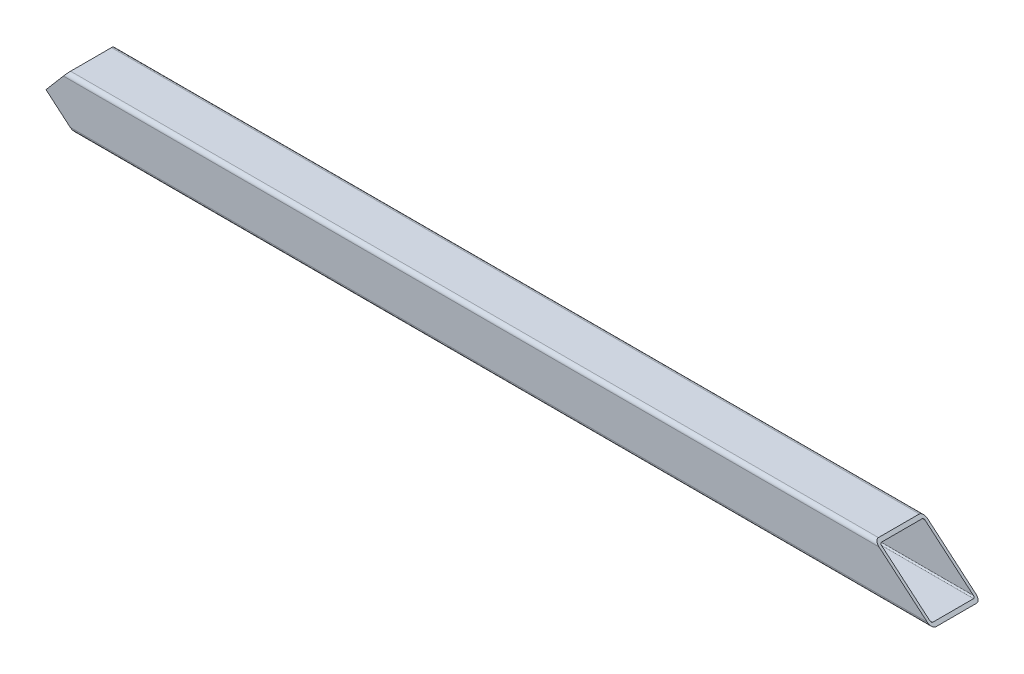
ISO-10303-21;
HEADER;
FILE_DESCRIPTION(('STEP AP214'),'2;1');
FILE_NAME('part.step','',(''),(''),'','','');
FILE_SCHEMA(('AUTOMOTIVE_DESIGN { 1 0 10303 214 1 1 1 1 }'));
ENDSEC;
DATA;
#1=APPLICATION_CONTEXT('core data for automotive mechanical design processes');
#2=APPLICATION_PROTOCOL_DEFINITION('international standard','automotive_design',2000,#1);
#3=PRODUCT_CONTEXT('',#1,'mechanical');
#4=PRODUCT('Part','Part','',(#3));
#5=PRODUCT_RELATED_PRODUCT_CATEGORY('part','',(#4));
#6=PRODUCT_DEFINITION_FORMATION('','',#4);
#7=PRODUCT_DEFINITION_CONTEXT('part definition',#1,'design');
#8=PRODUCT_DEFINITION('design','',#6,#7);
#9=PRODUCT_DEFINITION_SHAPE('','',#8);
#10=(LENGTH_UNIT() NAMED_UNIT(*) SI_UNIT(.MILLI.,.METRE.));
#11=(NAMED_UNIT(*) PLANE_ANGLE_UNIT() SI_UNIT($,.RADIAN.));
#12=(NAMED_UNIT(*) SI_UNIT($,.STERADIAN.) SOLID_ANGLE_UNIT());
#13=UNCERTAINTY_MEASURE_WITH_UNIT(LENGTH_MEASURE(1.E-05),#10,'distance_accuracy_value','');
#14=(GEOMETRIC_REPRESENTATION_CONTEXT(3) GLOBAL_UNCERTAINTY_ASSIGNED_CONTEXT((#13)) GLOBAL_UNIT_ASSIGNED_CONTEXT((#10,
#11,#12)) REPRESENTATION_CONTEXT('',''));
#15=CARTESIAN_POINT('',(0.,0.,0.));
#16=DIRECTION('',(0.,0.,1.));
#17=DIRECTION('',(1.,0.,0.));
#18=AXIS2_PLACEMENT_3D('',#15,#16,#17);
#19=CARTESIAN_POINT('',(698.5,1.651,29.21));
#20=DIRECTION('',(0.,1.,0.));
#21=DIRECTION('',(0.,0.,1.));
#22=AXIS2_PLACEMENT_3D('',#19,#20,#21);
#23=PLANE('',#22);
#24=DIRECTION('',(0.,0.,1.));
#25=VECTOR('',#24,1.);
#26=CARTESIAN_POINT('',(575.714429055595,1.651,29.21));
#27=LINE('',#26,#25);
#28=CARTESIAN_POINT('',(575.714429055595,1.651,2.54000000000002));
#29=VERTEX_POINT('',#28);
#30=CARTESIAN_POINT('',(575.714429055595,1.651,29.21));
#31=VERTEX_POINT('',#30);
#32=EDGE_CURVE('E47',#29,#31,#27,.T.);
#33=ORIENTED_EDGE('',*,*,#32,.F.);
#34=DIRECTION('',(-1.,0.,0.));
#35=VECTOR('',#34,1.);
#36=CARTESIAN_POINT('',(698.5,1.651,2.54000000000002));
#37=LINE('',#36,#35);
#38=CARTESIAN_POINT('',(16.7396240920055,1.651,2.54000000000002));
#39=VERTEX_POINT('',#38);
#40=EDGE_CURVE('E257',#29,#39,#37,.T.);
#41=ORIENTED_EDGE('',*,*,#40,.T.);
#42=DIRECTION('',(0.,0.,-1.));
#43=VECTOR('',#42,1.);
#44=CARTESIAN_POINT('',(16.7396240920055,1.651,29.21));
#45=LINE('',#44,#43);
#46=CARTESIAN_POINT('',(16.7396240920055,1.651,29.21));
#47=VERTEX_POINT('',#46);
#48=EDGE_CURVE('E302',#47,#39,#45,.T.);
#49=ORIENTED_EDGE('',*,*,#48,.F.);
#50=DIRECTION('',(-1.,0.,0.));
#51=VECTOR('',#50,1.);
#52=CARTESIAN_POINT('',(698.5,1.651,29.21));
#53=LINE('',#52,#51);
#54=EDGE_CURVE('E260',#31,#47,#53,.T.);
#55=ORIENTED_EDGE('',*,*,#54,.F.);
#56=EDGE_LOOP('',(#33,#41,#49,#55));
#57=FACE_BOUND('',#56,.T.);
#58=ADVANCED_FACE('F39',(#57),#23,.T.);
#59=CARTESIAN_POINT('',(698.5,2.54,29.21));
#60=DIRECTION('',(-1.,0.,0.));
#61=DIRECTION('',(0.,0.,1.));
#62=AXIS2_PLACEMENT_3D('',#59,#60,#61);
#63=CYLINDRICAL_SURFACE('',#62,0.889000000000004);
#64=CARTESIAN_POINT('',(574.668202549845,2.54,29.21));
#65=DIRECTION('',(-0.647524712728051,-0.762044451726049,0.));
#66=DIRECTION('',(-0.762044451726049,0.647524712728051,0.));
#67=AXIS2_PLACEMENT_3D('',#64,#65,#66);
#68=ELLIPSE('',#67,1.37292057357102,0.889000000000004);
#69=CARTESIAN_POINT('',(574.668202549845,2.54000000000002,30.099));
#70=VERTEX_POINT('',#69);
#71=EDGE_CURVE('E205',#31,#70,#68,.T.);
#72=ORIENTED_EDGE('',*,*,#71,.F.);
#73=ORIENTED_EDGE('',*,*,#54,.T.);
#74=CARTESIAN_POINT('',(15.6933975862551,2.54,29.21));
#75=DIRECTION('',(0.647524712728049,0.762044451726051,0.));
#76=DIRECTION('',(-0.762044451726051,0.647524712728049,0.));
#77=AXIS2_PLACEMENT_3D('',#74,#75,#76);
#78=ELLIPSE('',#77,1.37292057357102,0.889000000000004);
#79=CARTESIAN_POINT('',(15.6933975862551,2.54000000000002,30.099));
#80=VERTEX_POINT('',#79);
#81=EDGE_CURVE('E187',#80,#47,#78,.T.);
#82=ORIENTED_EDGE('',*,*,#81,.F.);
#83=DIRECTION('',(-1.,0.,0.));
#84=VECTOR('',#83,1.);
#85=CARTESIAN_POINT('',(698.5,2.54000000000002,30.099));
#86=LINE('',#85,#84);
#87=EDGE_CURVE('E263',#70,#80,#86,.T.);
#88=ORIENTED_EDGE('',*,*,#87,.F.);
#89=EDGE_LOOP('',(#72,#73,#82,#88));
#90=FACE_BOUND('',#89,.T.);
#91=ADVANCED_FACE('F314',(#90),#63,.F.);
#92=CARTESIAN_POINT('',(698.5,29.21,30.099));
#93=DIRECTION('',(0.,0.,-1.));
#94=DIRECTION('',(-1.,0.,0.));
#95=AXIS2_PLACEMENT_3D('',#92,#93,#94);
#96=PLANE('',#95);
#97=DIRECTION('',(-0.762044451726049,0.647524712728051,0.));
#98=VECTOR('',#97,1.);
#99=CARTESIAN_POINT('',(633.418667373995,-47.3814681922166,30.099));
#100=LINE('',#99,#98);
#101=CARTESIAN_POINT('',(543.281407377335,29.21,30.099));
#102=VERTEX_POINT('',#101);
#103=EDGE_CURVE('E207',#70,#102,#100,.T.);
#104=ORIENTED_EDGE('',*,*,#103,.F.);
#105=ORIENTED_EDGE('',*,*,#87,.T.);
#106=DIRECTION('',(0.762044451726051,-0.647524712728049,0.));
#107=VECTOR('',#106,1.);
#108=CARTESIAN_POINT('',(399.04709759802,-323.203457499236,30.099));
#109=LINE('',#108,#107);
#110=CARTESIAN_POINT('',(0.,15.875,30.099));
#111=VERTEX_POINT('',#110);
#112=EDGE_CURVE('E189',#111,#80,#109,.T.);
#113=ORIENTED_EDGE('',*,*,#112,.F.);
#114=DIRECTION('',(-0.647524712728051,-0.762044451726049,0.));
#115=VECTOR('',#114,1.);
#116=CARTESIAN_POINT('',(299.452902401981,368.288457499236,30.099));
#117=LINE('',#116,#115);
#118=CARTESIAN_POINT('',(11.3310214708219,29.21,30.099));
#119=VERTEX_POINT('',#118);
#120=EDGE_CURVE('E11',#119,#111,#117,.T.);
#121=ORIENTED_EDGE('',*,*,#120,.F.);
#122=DIRECTION('',(-1.,0.,0.));
#123=VECTOR('',#122,1.);
#124=CARTESIAN_POINT('',(698.5,29.21,30.099));
#125=LINE('',#124,#123);
#126=EDGE_CURVE('E266',#102,#119,#125,.T.);
#127=ORIENTED_EDGE('',*,*,#126,.F.);
#128=EDGE_LOOP('',(#104,#105,#113,#121,#127));
#129=FACE_BOUND('',#128,.T.);
#130=ADVANCED_FACE('F353',(#129),#96,.T.);
#131=CARTESIAN_POINT('',(698.5,29.21,29.21));
#132=DIRECTION('',(-1.,0.,0.));
#133=DIRECTION('',(0.,0.,1.));
#134=AXIS2_PLACEMENT_3D('',#131,#132,#133);
#135=CYLINDRICAL_SURFACE('',#134,0.889000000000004);
#136=CARTESIAN_POINT('',(543.281407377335,29.21,29.21));
#137=DIRECTION('',(-0.647524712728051,-0.762044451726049,0.));
#138=DIRECTION('',(-0.762044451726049,0.647524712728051,0.));
#139=AXIS2_PLACEMENT_3D('',#136,#137,#138);
#140=ELLIPSE('',#139,1.37292057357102,0.889000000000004);
#141=CARTESIAN_POINT('',(542.235180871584,30.099,29.21));
#142=VERTEX_POINT('',#141);
#143=EDGE_CURVE('E209',#102,#142,#140,.T.);
#144=ORIENTED_EDGE('',*,*,#143,.F.);
#145=ORIENTED_EDGE('',*,*,#126,.T.);
#146=CARTESIAN_POINT('',(11.3310214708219,29.21,29.21));
#147=DIRECTION('',(0.762044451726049,-0.647524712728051,0.));
#148=DIRECTION('',(-0.647524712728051,-0.762044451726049,0.));
#149=AXIS2_PLACEMENT_3D('',#146,#147,#148);
#150=ELLIPSE('',#149,1.16659861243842,0.889000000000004);
#151=CARTESIAN_POINT('',(12.08642290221,30.099,29.21));
#152=VERTEX_POINT('',#151);
#153=EDGE_CURVE('E238',#152,#119,#150,.T.);
#154=ORIENTED_EDGE('',*,*,#153,.F.);
#155=DIRECTION('',(-1.,0.,0.));
#156=VECTOR('',#155,1.);
#157=CARTESIAN_POINT('',(698.5,30.099,29.21));
#158=LINE('',#157,#156);
#159=EDGE_CURVE('E269',#142,#152,#158,.T.);
#160=ORIENTED_EDGE('',*,*,#159,.F.);
#161=EDGE_LOOP('',(#144,#145,#154,#160));
#162=FACE_BOUND('',#161,.T.);
#163=ADVANCED_FACE('F360',(#162),#135,.F.);
#164=CARTESIAN_POINT('',(698.5,30.099,2.54000000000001));
#165=DIRECTION('',(0.,-1.,0.));
#166=DIRECTION('',(0.,0.,-1.));
#167=AXIS2_PLACEMENT_3D('',#164,#165,#166);
#168=PLANE('',#167);
#169=DIRECTION('',(0.,0.,-1.));
#170=VECTOR('',#169,1.);
#171=CARTESIAN_POINT('',(542.235180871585,30.099,2.54000000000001));
#172=LINE('',#171,#170);
#173=CARTESIAN_POINT('',(542.235180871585,30.099,2.54000000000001));
#174=VERTEX_POINT('',#173);
#175=EDGE_CURVE('E211',#142,#174,#172,.T.);
#176=ORIENTED_EDGE('',*,*,#175,.F.);
#177=ORIENTED_EDGE('',*,*,#159,.T.);
#178=DIRECTION('',(0.,0.,1.));
#179=VECTOR('',#178,1.);
#180=CARTESIAN_POINT('',(12.0864229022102,30.099,2.54000000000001));
#181=LINE('',#180,#179);
#182=CARTESIAN_POINT('',(12.0864229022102,30.099,2.54000000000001));
#183=VERTEX_POINT('',#182);
#184=EDGE_CURVE('E240',#183,#152,#181,.T.);
#185=ORIENTED_EDGE('',*,*,#184,.F.);
#186=DIRECTION('',(-1.,0.,0.));
#187=VECTOR('',#186,1.);
#188=CARTESIAN_POINT('',(698.5,30.099,2.54000000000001));
#189=LINE('',#188,#187);
#190=EDGE_CURVE('E272',#174,#183,#189,.T.);
#191=ORIENTED_EDGE('',*,*,#190,.F.);
#192=EDGE_LOOP('',(#176,#177,#185,#191));
#193=FACE_BOUND('',#192,.T.);
#194=ADVANCED_FACE('F364',(#193),#168,.T.);
#195=CARTESIAN_POINT('',(698.5,29.21,2.54));
#196=DIRECTION('',(-1.,0.,0.));
#197=DIRECTION('',(0.,0.,1.));
#198=AXIS2_PLACEMENT_3D('',#195,#196,#197);
#199=CYLINDRICAL_SURFACE('',#198,0.889);
#200=CARTESIAN_POINT('',(543.281407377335,29.21,2.54));
#201=DIRECTION('',(-0.647524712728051,-0.762044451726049,0.));
#202=DIRECTION('',(-0.762044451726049,0.647524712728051,0.));
#203=AXIS2_PLACEMENT_3D('',#200,#201,#202);
#204=ELLIPSE('',#203,1.37292057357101,0.889);
#205=CARTESIAN_POINT('',(543.281407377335,29.21,1.651));
#206=VERTEX_POINT('',#205);
#207=EDGE_CURVE('E213',#174,#206,#204,.T.);
#208=ORIENTED_EDGE('',*,*,#207,.F.);
#209=ORIENTED_EDGE('',*,*,#190,.T.);
#210=CARTESIAN_POINT('',(11.3310214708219,29.21,2.54));
#211=DIRECTION('',(0.762044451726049,-0.647524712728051,0.));
#212=DIRECTION('',(-0.647524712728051,-0.762044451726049,0.));
#213=AXIS2_PLACEMENT_3D('',#210,#211,#212);
#214=ELLIPSE('',#213,1.16659861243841,0.889);
#215=CARTESIAN_POINT('',(11.3310214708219,29.21,1.651));
#216=VERTEX_POINT('',#215);
#217=EDGE_CURVE('E242',#216,#183,#214,.T.);
#218=ORIENTED_EDGE('',*,*,#217,.F.);
#219=DIRECTION('',(-1.,0.,0.));
#220=VECTOR('',#219,1.);
#221=CARTESIAN_POINT('',(698.5,29.21,1.651));
#222=LINE('',#221,#220);
#223=EDGE_CURVE('E275',#206,#216,#222,.T.);
#224=ORIENTED_EDGE('',*,*,#223,.F.);
#225=EDGE_LOOP('',(#208,#209,#218,#224));
#226=FACE_BOUND('',#225,.T.);
#227=ADVANCED_FACE('F368',(#226),#199,.F.);
#228=CARTESIAN_POINT('',(698.5,2.54000000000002,1.651));
#229=DIRECTION('',(0.,0.,1.));
#230=DIRECTION('',(1.,0.,0.));
#231=AXIS2_PLACEMENT_3D('',#228,#229,#230);
#232=PLANE('',#231);
#233=DIRECTION('',(0.762044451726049,-0.647524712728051,0.));
#234=VECTOR('',#233,1.);
#235=CARTESIAN_POINT('',(646.578781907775,-58.5638859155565,1.651));
#236=LINE('',#235,#234);
#237=CARTESIAN_POINT('',(574.668202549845,2.54000000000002,1.651));
#238=VERTEX_POINT('',#237);
#239=EDGE_CURVE('E215',#206,#238,#236,.T.);
#240=ORIENTED_EDGE('',*,*,#239,.F.);
#241=ORIENTED_EDGE('',*,*,#223,.T.);
#242=DIRECTION('',(0.647524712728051,0.762044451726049,0.));
#243=VECTOR('',#242,1.);
#244=CARTESIAN_POINT('',(286.292787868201,352.800875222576,1.651));
#245=LINE('',#244,#243);
#246=CARTESIAN_POINT('',(0.,15.875,1.651));
#247=VERTEX_POINT('',#246);
#248=EDGE_CURVE('E244',#247,#216,#245,.T.);
#249=ORIENTED_EDGE('',*,*,#248,.F.);
#250=DIRECTION('',(-0.762044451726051,0.647524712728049,0.));
#251=VECTOR('',#250,1.);
#252=CARTESIAN_POINT('',(412.2072121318,-334.385875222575,1.651));
#253=LINE('',#252,#251);
#254=CARTESIAN_POINT('',(15.6933975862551,2.54000000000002,1.651));
#255=VERTEX_POINT('',#254);
#256=EDGE_CURVE('E193',#255,#247,#253,.T.);
#257=ORIENTED_EDGE('',*,*,#256,.F.);
#258=DIRECTION('',(-1.,0.,0.));
#259=VECTOR('',#258,1.);
#260=CARTESIAN_POINT('',(698.5,2.54000000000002,1.651));
#261=LINE('',#260,#259);
#262=EDGE_CURVE('E278',#238,#255,#261,.T.);
#263=ORIENTED_EDGE('',*,*,#262,.F.);
#264=EDGE_LOOP('',(#240,#241,#249,#257,#263));
#265=FACE_BOUND('',#264,.T.);
#266=ADVANCED_FACE('F324',(#265),#232,.T.);
#267=CARTESIAN_POINT('',(698.5,2.54,2.54));
#268=DIRECTION('',(-1.,0.,0.));
#269=DIRECTION('',(0.,0.,1.));
#270=AXIS2_PLACEMENT_3D('',#267,#268,#269);
#271=CYLINDRICAL_SURFACE('',#270,0.889);
#272=CARTESIAN_POINT('',(574.668202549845,2.54,2.54));
#273=DIRECTION('',(-0.647524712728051,-0.762044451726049,0.));
#274=DIRECTION('',(-0.762044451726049,0.647524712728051,0.));
#275=AXIS2_PLACEMENT_3D('',#272,#273,#274);
#276=ELLIPSE('',#275,1.37292057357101,0.889);
#277=EDGE_CURVE('E217',#238,#29,#276,.T.);
#278=ORIENTED_EDGE('',*,*,#277,.F.);
#279=ORIENTED_EDGE('',*,*,#262,.T.);
#280=CARTESIAN_POINT('',(15.6933975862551,2.54,2.54));
#281=DIRECTION('',(0.647524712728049,0.762044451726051,0.));
#282=DIRECTION('',(-0.762044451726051,0.647524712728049,0.));
#283=AXIS2_PLACEMENT_3D('',#280,#281,#282);
#284=ELLIPSE('',#283,1.37292057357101,0.889);
#285=EDGE_CURVE('E191',#39,#255,#284,.T.);
#286=ORIENTED_EDGE('',*,*,#285,.F.);
#287=ORIENTED_EDGE('',*,*,#40,.F.);
#288=EDGE_LOOP('',(#278,#279,#286,#287));
#289=FACE_BOUND('',#288,.T.);
#290=ADVANCED_FACE('F320',(#289),#271,.F.);
#291=CARTESIAN_POINT('',(0.,15.875,-6.35000000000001));
#292=DIRECTION('',(0.762044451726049,-0.647524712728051,0.));
#293=DIRECTION('',(0.647524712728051,0.762044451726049,0.));
#294=AXIS2_PLACEMENT_3D('',#291,#292,#293);
#295=PLANE('',#294);
#296=DIRECTION('',(0.,0.,1.));
#297=VECTOR('',#296,1.);
#298=CARTESIAN_POINT('',(0.,15.875,-6.35000000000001));
#299=LINE('',#298,#297);
#300=CARTESIAN_POINT('',(0.,15.875,0.));
#301=VERTEX_POINT('',#300);
#302=EDGE_CURVE('E171',#301,#247,#299,.T.);
#303=ORIENTED_EDGE('',*,*,#302,.T.);
#304=ORIENTED_EDGE('',*,*,#248,.T.);
#305=ORIENTED_EDGE('',*,*,#217,.T.);
#306=ORIENTED_EDGE('',*,*,#184,.T.);
#307=ORIENTED_EDGE('',*,*,#153,.T.);
#308=ORIENTED_EDGE('',*,*,#120,.T.);
#309=CARTESIAN_POINT('',(0.,15.875,31.75));
#310=VERTEX_POINT('',#309);
#311=EDGE_CURVE('E163',#111,#310,#299,.T.);
#312=ORIENTED_EDGE('',*,*,#311,.T.);
#313=DIRECTION('',(0.647524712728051,0.762044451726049,0.));
#314=VECTOR('',#313,1.);
#315=CARTESIAN_POINT('',(0.,15.875,31.75));
#316=LINE('',#315,#314);
#317=CARTESIAN_POINT('',(11.3310214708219,29.21,31.75));
#318=VERTEX_POINT('',#317);
#319=EDGE_CURVE('E167',#310,#318,#316,.T.);
#320=ORIENTED_EDGE('',*,*,#319,.T.);
#321=CARTESIAN_POINT('',(11.3310214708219,29.21,29.21));
#322=DIRECTION('',(0.762044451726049,-0.647524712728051,0.));
#323=DIRECTION('',(-0.647524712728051,-0.762044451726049,0.));
#324=AXIS2_PLACEMENT_3D('',#321,#322,#323);
#325=ELLIPSE('',#324,3.33313889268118,2.54);
#326=CARTESIAN_POINT('',(13.489311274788,31.75,29.21));
#327=VERTEX_POINT('',#326);
#328=EDGE_CURVE('E246',#327,#318,#325,.T.);
#329=ORIENTED_EDGE('',*,*,#328,.F.);
#330=DIRECTION('',(0.,0.,1.));
#331=VECTOR('',#330,1.);
#332=CARTESIAN_POINT('',(13.489311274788,31.75,2.53999999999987));
#333=LINE('',#332,#331);
#334=CARTESIAN_POINT('',(13.489311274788,31.75,2.54000000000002));
#335=VERTEX_POINT('',#334);
#336=EDGE_CURVE('E248',#335,#327,#333,.T.);
#337=ORIENTED_EDGE('',*,*,#336,.F.);
#338=CARTESIAN_POINT('',(11.3310214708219,29.21,2.54));
#339=DIRECTION('',(0.762044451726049,-0.647524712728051,0.));
#340=DIRECTION('',(-0.647524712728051,-0.762044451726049,0.));
#341=AXIS2_PLACEMENT_3D('',#338,#339,#340);
#342=ELLIPSE('',#341,3.33313889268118,2.54);
#343=CARTESIAN_POINT('',(11.3310214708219,29.21,0.));
#344=VERTEX_POINT('',#343);
#345=EDGE_CURVE('E251',#344,#335,#342,.T.);
#346=ORIENTED_EDGE('',*,*,#345,.F.);
#347=DIRECTION('',(0.647524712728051,0.762044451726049,0.));
#348=VECTOR('',#347,1.);
#349=CARTESIAN_POINT('',(286.292787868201,352.800875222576,0.));
#350=LINE('',#349,#348);
#351=EDGE_CURVE('E254',#301,#344,#350,.T.);
#352=ORIENTED_EDGE('',*,*,#351,.F.);
#353=EDGE_LOOP('',(#303,#304,#305,#306,#307,#308,#312,#320,#329,#337,#346,#352));
#354=FACE_BOUND('',#353,.T.);
#355=ADVANCED_FACE('F165',(#354),#295,.F.);
#356=CARTESIAN_POINT('',(20.623884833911,-1.64953557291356,-6.35000000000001));
#357=DIRECTION('',(0.647524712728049,0.762044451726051,0.));
#358=DIRECTION('',(-0.762044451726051,0.647524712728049,0.));
#359=AXIS2_PLACEMENT_3D('',#356,#357,#358);
#360=PLANE('',#359);
#361=DIRECTION('',(-0.762044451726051,0.647524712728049,0.));
#362=VECTOR('',#361,1.);
#363=CARTESIAN_POINT('',(20.623884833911,-1.64953557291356,31.75));
#364=LINE('',#363,#362);
#365=CARTESIAN_POINT('',(15.693397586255,2.54,31.75));
#366=VERTEX_POINT('',#365);
#367=EDGE_CURVE('E173',#366,#310,#364,.T.);
#368=ORIENTED_EDGE('',*,*,#367,.T.);
#369=ORIENTED_EDGE('',*,*,#311,.F.);
#370=ORIENTED_EDGE('',*,*,#112,.T.);
#371=ORIENTED_EDGE('',*,*,#81,.T.);
#372=ORIENTED_EDGE('',*,*,#48,.T.);
#373=ORIENTED_EDGE('',*,*,#285,.T.);
#374=ORIENTED_EDGE('',*,*,#256,.T.);
#375=ORIENTED_EDGE('',*,*,#302,.F.);
#376=DIRECTION('',(-0.762044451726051,0.647524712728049,0.));
#377=VECTOR('',#376,1.);
#378=CARTESIAN_POINT('',(412.2072121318,-334.385875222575,0.));
#379=LINE('',#378,#377);
#380=CARTESIAN_POINT('',(15.693397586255,2.54000000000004,0.));
#381=VERTEX_POINT('',#380);
#382=EDGE_CURVE('E195',#381,#301,#379,.T.);
#383=ORIENTED_EDGE('',*,*,#382,.F.);
#384=CARTESIAN_POINT('',(15.6933975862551,2.54,2.54));
#385=DIRECTION('',(0.647524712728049,0.762044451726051,0.));
#386=DIRECTION('',(-0.762044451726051,0.647524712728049,0.));
#387=AXIS2_PLACEMENT_3D('',#384,#385,#386);
#388=ELLIPSE('',#387,3.9226302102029,2.54);
#389=CARTESIAN_POINT('',(18.6826161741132,0.,2.54000000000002));
#390=VERTEX_POINT('',#389);
#391=EDGE_CURVE('E198',#390,#381,#388,.T.);
#392=ORIENTED_EDGE('',*,*,#391,.F.);
#393=DIRECTION('',(0.,0.,-1.));
#394=VECTOR('',#393,1.);
#395=CARTESIAN_POINT('',(18.6826161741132,0.,29.21));
#396=LINE('',#395,#394);
#397=CARTESIAN_POINT('',(18.6826161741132,0.,29.21));
#398=VERTEX_POINT('',#397);
#399=EDGE_CURVE('E201',#398,#390,#396,.T.);
#400=ORIENTED_EDGE('',*,*,#399,.F.);
#401=CARTESIAN_POINT('',(15.6933975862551,2.54,29.21));
#402=DIRECTION('',(0.647524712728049,0.762044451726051,0.));
#403=DIRECTION('',(-0.762044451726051,0.647524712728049,0.));
#404=AXIS2_PLACEMENT_3D('',#401,#402,#403);
#405=ELLIPSE('',#404,3.9226302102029,2.54);
#406=EDGE_CURVE('E62',#366,#398,#405,.T.);
#407=ORIENTED_EDGE('',*,*,#406,.F.);
#408=EDGE_LOOP('',(#368,#369,#370,#371,#372,#373,#374,#375,#383,#392,#400,#407));
#409=FACE_BOUND('',#408,.T.);
#410=ADVANCED_FACE('F174',(#409),#360,.F.);
#411=CARTESIAN_POINT('',(583.843029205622,-5.25603733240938,-6.35000000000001));
#412=DIRECTION('',(-0.647524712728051,-0.762044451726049,0.));
#413=DIRECTION('',(0.762044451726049,-0.647524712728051,0.));
#414=AXIS2_PLACEMENT_3D('',#411,#412,#413);
#415=PLANE('',#414);
#416=ORIENTED_EDGE('',*,*,#277,.T.);
#417=ORIENTED_EDGE('',*,*,#32,.T.);
#418=ORIENTED_EDGE('',*,*,#71,.T.);
#419=ORIENTED_EDGE('',*,*,#103,.T.);
#420=ORIENTED_EDGE('',*,*,#143,.T.);
#421=ORIENTED_EDGE('',*,*,#175,.T.);
#422=ORIENTED_EDGE('',*,*,#207,.T.);
#423=ORIENTED_EDGE('',*,*,#239,.T.);
#424=EDGE_LOOP('',(#416,#417,#418,#419,#420,#421,#422,#423));
#425=FACE_BOUND('',#424,.T.);
#426=DIRECTION('',(0.,0.,1.));
#427=VECTOR('',#426,1.);
#428=CARTESIAN_POINT('',(577.657421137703,0.,29.21));
#429=LINE('',#428,#427);
#430=CARTESIAN_POINT('',(577.657421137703,0.,2.54000000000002));
#431=VERTEX_POINT('',#430);
#432=CARTESIAN_POINT('',(577.657421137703,0.,29.21));
#433=VERTEX_POINT('',#432);
#434=EDGE_CURVE('E232',#431,#433,#429,.T.);
#435=ORIENTED_EDGE('',*,*,#434,.F.);
#436=CARTESIAN_POINT('',(574.668202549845,2.54,2.54));
#437=DIRECTION('',(-0.647524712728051,-0.762044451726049,0.));
#438=DIRECTION('',(-0.762044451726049,0.647524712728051,0.));
#439=AXIS2_PLACEMENT_3D('',#436,#437,#438);
#440=ELLIPSE('',#439,3.92263021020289,2.54);
#441=CARTESIAN_POINT('',(574.668202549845,2.54000000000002,0.));
#442=VERTEX_POINT('',#441);
#443=EDGE_CURVE('E229',#442,#431,#440,.T.);
#444=ORIENTED_EDGE('',*,*,#443,.F.);
#445=DIRECTION('',(0.762044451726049,-0.647524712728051,0.));
#446=VECTOR('',#445,1.);
#447=CARTESIAN_POINT('',(646.578781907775,-58.5638859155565,0.));
#448=LINE('',#447,#446);
#449=CARTESIAN_POINT('',(543.281407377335,29.21,0.));
#450=VERTEX_POINT('',#449);
#451=EDGE_CURVE('E226',#450,#442,#448,.T.);
#452=ORIENTED_EDGE('',*,*,#451,.F.);
#453=CARTESIAN_POINT('',(543.281407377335,29.21,2.54));
#454=DIRECTION('',(-0.647524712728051,-0.762044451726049,0.));
#455=DIRECTION('',(-0.762044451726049,0.647524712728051,0.));
#456=AXIS2_PLACEMENT_3D('',#453,#454,#455);
#457=ELLIPSE('',#456,3.92263021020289,2.54);
#458=CARTESIAN_POINT('',(540.292188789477,31.75,2.54000000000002));
#459=VERTEX_POINT('',#458);
#460=EDGE_CURVE('E223',#459,#450,#457,.T.);
#461=ORIENTED_EDGE('',*,*,#460,.F.);
#462=DIRECTION('',(0.,0.,-1.));
#463=VECTOR('',#462,1.);
#464=CARTESIAN_POINT('',(540.292188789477,31.75,2.54000000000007));
#465=LINE('',#464,#463);
#466=CARTESIAN_POINT('',(540.292188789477,31.75,29.21));
#467=VERTEX_POINT('',#466);
#468=EDGE_CURVE('E220',#467,#459,#465,.T.);
#469=ORIENTED_EDGE('',*,*,#468,.F.);
#470=CARTESIAN_POINT('',(543.281407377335,29.21,29.21));
#471=DIRECTION('',(-0.647524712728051,-0.762044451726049,0.));
#472=DIRECTION('',(-0.762044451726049,0.647524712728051,0.));
#473=AXIS2_PLACEMENT_3D('',#470,#471,#472);
#474=ELLIPSE('',#473,3.92263021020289,2.54);
#475=CARTESIAN_POINT('',(543.281407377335,29.21,31.75));
#476=VERTEX_POINT('',#475);
#477=EDGE_CURVE('E54',#476,#467,#474,.T.);
#478=ORIENTED_EDGE('',*,*,#477,.F.);
#479=DIRECTION('',(0.762044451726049,-0.647524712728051,0.));
#480=VECTOR('',#479,1.);
#481=CARTESIAN_POINT('',(583.843029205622,-5.25603733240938,31.75));
#482=LINE('',#481,#480);
#483=CARTESIAN_POINT('',(574.668202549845,2.54,31.75));
#484=VERTEX_POINT('',#483);
#485=EDGE_CURVE('E178',#476,#484,#482,.T.);
#486=ORIENTED_EDGE('',*,*,#485,.T.);
#487=CARTESIAN_POINT('',(574.668202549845,2.54,29.21));
#488=DIRECTION('',(-0.647524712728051,-0.762044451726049,0.));
#489=DIRECTION('',(-0.762044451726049,0.647524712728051,0.));
#490=AXIS2_PLACEMENT_3D('',#487,#488,#489);
#491=ELLIPSE('',#490,3.92263021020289,2.54);
#492=EDGE_CURVE('E235',#433,#484,#491,.T.);
#493=ORIENTED_EDGE('',*,*,#492,.F.);
#494=EDGE_LOOP('',(#435,#444,#452,#461,#469,#478,#486,#493));
#495=FACE_BOUND('',#494,.T.);
#496=ADVANCED_FACE('F306',(#425,#495),#415,.F.);
#497=CARTESIAN_POINT('',(698.5,2.54,29.21));
#498=DIRECTION('',(-1.,0.,0.));
#499=DIRECTION('',(0.,0.,1.));
#500=AXIS2_PLACEMENT_3D('',#497,#498,#499);
#501=CYLINDRICAL_SURFACE('',#500,2.54);
#502=DIRECTION('',(-1.,0.,0.));
#503=VECTOR('',#502,1.);
#504=CARTESIAN_POINT('',(698.5,0.,29.21));
#505=LINE('',#504,#503);
#506=EDGE_CURVE('E299',#433,#398,#505,.T.);
#507=ORIENTED_EDGE('',*,*,#506,.F.);
#508=ORIENTED_EDGE('',*,*,#492,.T.);
#509=DIRECTION('',(-1.,0.,0.));
#510=VECTOR('',#509,1.);
#511=CARTESIAN_POINT('',(698.5,2.54000000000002,31.75));
#512=LINE('',#511,#510);
#513=EDGE_CURVE('E281',#484,#366,#512,.T.);
#514=ORIENTED_EDGE('',*,*,#513,.T.);
#515=ORIENTED_EDGE('',*,*,#406,.T.);
#516=EDGE_LOOP('',(#507,#508,#514,#515));
#517=FACE_BOUND('',#516,.T.);
#518=ADVANCED_FACE('F41',(#517),#501,.T.);
#519=CARTESIAN_POINT('',(698.5,0.,29.21));
#520=DIRECTION('',(0.,1.,0.));
#521=DIRECTION('',(0.,0.,1.));
#522=AXIS2_PLACEMENT_3D('',#519,#520,#521);
#523=PLANE('',#522);
#524=DIRECTION('',(-1.,0.,0.));
#525=VECTOR('',#524,1.);
#526=CARTESIAN_POINT('',(698.5,0.,2.54000000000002));
#527=LINE('',#526,#525);
#528=EDGE_CURVE('E296',#431,#390,#527,.T.);
#529=ORIENTED_EDGE('',*,*,#528,.F.);
#530=ORIENTED_EDGE('',*,*,#434,.T.);
#531=ORIENTED_EDGE('',*,*,#506,.T.);
#532=ORIENTED_EDGE('',*,*,#399,.T.);
#533=EDGE_LOOP('',(#529,#530,#531,#532));
#534=FACE_BOUND('',#533,.T.);
#535=ADVANCED_FACE('F389',(#534),#523,.F.);
#536=CARTESIAN_POINT('',(698.5,2.54,2.54));
#537=DIRECTION('',(-1.,0.,0.));
#538=DIRECTION('',(0.,0.,1.));
#539=AXIS2_PLACEMENT_3D('',#536,#537,#538);
#540=CYLINDRICAL_SURFACE('',#539,2.54);
#541=DIRECTION('',(-1.,0.,0.));
#542=VECTOR('',#541,1.);
#543=CARTESIAN_POINT('',(698.5,2.54000000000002,0.));
#544=LINE('',#543,#542);
#545=EDGE_CURVE('E293',#442,#381,#544,.T.);
#546=ORIENTED_EDGE('',*,*,#545,.F.);
#547=ORIENTED_EDGE('',*,*,#443,.T.);
#548=ORIENTED_EDGE('',*,*,#528,.T.);
#549=ORIENTED_EDGE('',*,*,#391,.T.);
#550=EDGE_LOOP('',(#546,#547,#548,#549));
#551=FACE_BOUND('',#550,.T.);
#552=ADVANCED_FACE('F394',(#551),#540,.T.);
#553=CARTESIAN_POINT('',(698.5,2.54000000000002,0.));
#554=DIRECTION('',(0.,0.,1.));
#555=DIRECTION('',(1.,0.,0.));
#556=AXIS2_PLACEMENT_3D('',#553,#554,#555);
#557=PLANE('',#556);
#558=DIRECTION('',(-1.,0.,0.));
#559=VECTOR('',#558,1.);
#560=CARTESIAN_POINT('',(698.5,29.21,0.));
#561=LINE('',#560,#559);
#562=EDGE_CURVE('E290',#450,#344,#561,.T.);
#563=ORIENTED_EDGE('',*,*,#562,.F.);
#564=ORIENTED_EDGE('',*,*,#451,.T.);
#565=ORIENTED_EDGE('',*,*,#545,.T.);
#566=ORIENTED_EDGE('',*,*,#382,.T.);
#567=ORIENTED_EDGE('',*,*,#351,.T.);
#568=EDGE_LOOP('',(#563,#564,#565,#566,#567));
#569=FACE_BOUND('',#568,.T.);
#570=ADVANCED_FACE('F331',(#569),#557,.F.);
#571=CARTESIAN_POINT('',(698.5,29.21,2.54));
#572=DIRECTION('',(-1.,0.,0.));
#573=DIRECTION('',(0.,0.,1.));
#574=AXIS2_PLACEMENT_3D('',#571,#572,#573);
#575=CYLINDRICAL_SURFACE('',#574,2.54);
#576=DIRECTION('',(-1.,0.,0.));
#577=VECTOR('',#576,1.);
#578=CARTESIAN_POINT('',(698.5,31.75,2.54000000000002));
#579=LINE('',#578,#577);
#580=EDGE_CURVE('E287',#459,#335,#579,.T.);
#581=ORIENTED_EDGE('',*,*,#580,.F.);
#582=ORIENTED_EDGE('',*,*,#460,.T.);
#583=ORIENTED_EDGE('',*,*,#562,.T.);
#584=ORIENTED_EDGE('',*,*,#345,.T.);
#585=EDGE_LOOP('',(#581,#582,#583,#584));
#586=FACE_BOUND('',#585,.T.);
#587=ADVANCED_FACE('F334',(#586),#575,.T.);
#588=CARTESIAN_POINT('',(698.5,31.75,2.54000000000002));
#589=DIRECTION('',(0.,-1.,0.));
#590=DIRECTION('',(0.,0.,-1.));
#591=AXIS2_PLACEMENT_3D('',#588,#589,#590);
#592=PLANE('',#591);
#593=DIRECTION('',(-1.,0.,0.));
#594=VECTOR('',#593,1.);
#595=CARTESIAN_POINT('',(698.5,31.75,29.21));
#596=LINE('',#595,#594);
#597=EDGE_CURVE('E284',#467,#327,#596,.T.);
#598=ORIENTED_EDGE('',*,*,#597,.F.);
#599=ORIENTED_EDGE('',*,*,#468,.T.);
#600=ORIENTED_EDGE('',*,*,#580,.T.);
#601=ORIENTED_EDGE('',*,*,#336,.T.);
#602=EDGE_LOOP('',(#598,#599,#600,#601));
#603=FACE_BOUND('',#602,.T.);
#604=ADVANCED_FACE('F337',(#603),#592,.F.);
#605=CARTESIAN_POINT('',(698.5,29.21,29.21));
#606=DIRECTION('',(-1.,0.,0.));
#607=DIRECTION('',(0.,0.,1.));
#608=AXIS2_PLACEMENT_3D('',#605,#606,#607);
#609=CYLINDRICAL_SURFACE('',#608,2.54);
#610=DIRECTION('',(-1.,0.,0.));
#611=VECTOR('',#610,1.);
#612=CARTESIAN_POINT('',(698.5,29.21,31.75));
#613=LINE('',#612,#611);
#614=EDGE_CURVE('E183',#476,#318,#613,.T.);
#615=ORIENTED_EDGE('',*,*,#614,.F.);
#616=ORIENTED_EDGE('',*,*,#477,.T.);
#617=ORIENTED_EDGE('',*,*,#597,.T.);
#618=ORIENTED_EDGE('',*,*,#328,.T.);
#619=EDGE_LOOP('',(#615,#616,#617,#618));
#620=FACE_BOUND('',#619,.T.);
#621=ADVANCED_FACE('F339',(#620),#609,.T.);
#622=CARTESIAN_POINT('',(698.5,29.21,31.75));
#623=DIRECTION('',(0.,0.,-1.));
#624=DIRECTION('',(0.,1.,0.));
#625=AXIS2_PLACEMENT_3D('',#622,#623,#624);
#626=PLANE('',#625);
#627=ORIENTED_EDGE('',*,*,#513,.F.);
#628=ORIENTED_EDGE('',*,*,#485,.F.);
#629=ORIENTED_EDGE('',*,*,#614,.T.);
#630=ORIENTED_EDGE('',*,*,#319,.F.);
#631=ORIENTED_EDGE('',*,*,#367,.F.);
#632=EDGE_LOOP('',(#627,#628,#629,#630,#631));
#633=FACE_BOUND('',#632,.T.);
#634=ADVANCED_FACE('F181',(#633),#626,.F.);
#635=CLOSED_SHELL('',(#58,#91,#130,#163,#194,#227,#266,#290,#355,#410,#496,#518,#535,#552,#570,
#587,#604,#621,#634));
#636=MANIFOLD_SOLID_BREP('B2',#635);
#637=ADVANCED_BREP_SHAPE_REPRESENTATION('',(#18,#636),#14);
#638=SHAPE_DEFINITION_REPRESENTATION(#9,#637);
ENDSEC;
END-ISO-10303-21;
